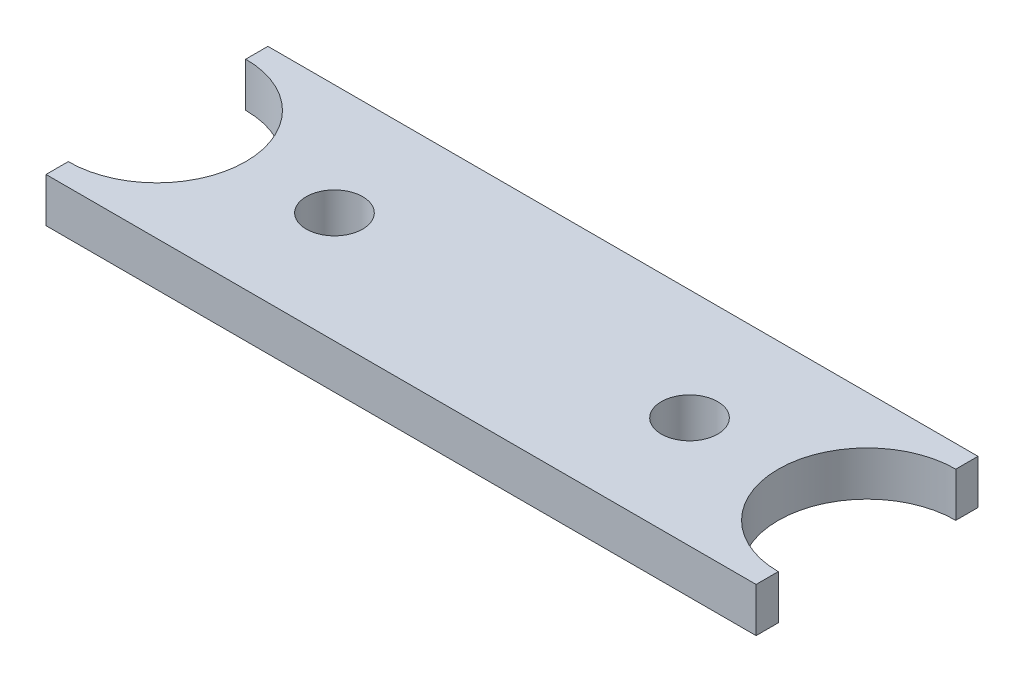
from build123d import *

# Parameters (mm, degrees)
SKETCH1_R      = 3.175
EXTRUDE1_DEPTH = 5


with BuildPart() as part:
    # Sketch1 → Extrude1 (new body)
    with BuildSketch(Plane(origin=(0, 0, 0), x_dir=(1, 0, 0), z_dir=(0, 1, 0))):
        with BuildLine():
            Line((-40, 12.5), (40, 12.5))
            Line((40, 12.5), (40, 10))
            ThreePointArc((40, 10), (30, 0), (40, -10))
            Line((40, -10), (40, -12.5))
            Line((40, -12.5), (-40, -12.5))
            Line((-40, -12.5), (-40, -10))
            ThreePointArc((-40, -10), (-30, 0), (-40, 10))
            Line((-40, 10), (-40, 12.5))
        make_face()
        with Locations(Location((20, 0, 0), (0, 0, 270))):
            Circle(SKETCH1_R, mode=Mode.SUBTRACT)
        with Locations(Location((-20, 0, 0), (0, 0, 270))):
            Circle(SKETCH1_R, mode=Mode.SUBTRACT)
    extrude(amount=EXTRUDE1_DEPTH)


solid = part.part
